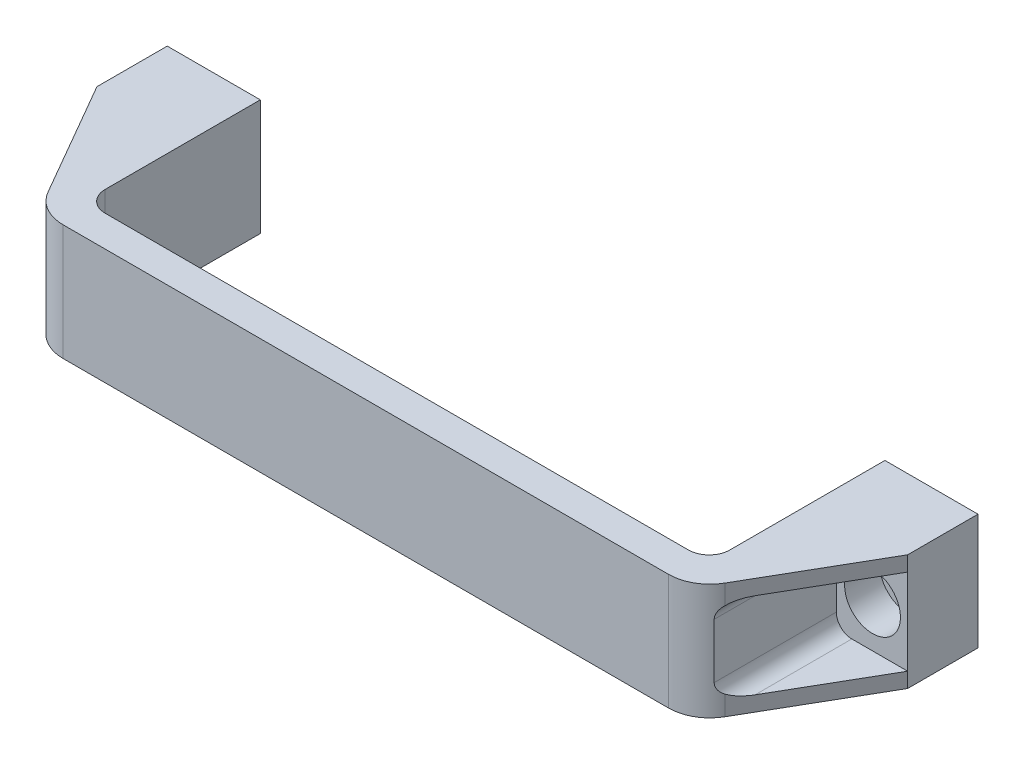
ISO-10303-21;
HEADER;
FILE_DESCRIPTION(('STEP AP214'),'2;1');
FILE_NAME('part.step','',(''),(''),'','','');
FILE_SCHEMA(('AUTOMOTIVE_DESIGN { 1 0 10303 214 1 1 1 1 }'));
ENDSEC;
DATA;
#1=APPLICATION_CONTEXT('core data for automotive mechanical design processes');
#2=APPLICATION_PROTOCOL_DEFINITION('international standard','automotive_design',2000,#1);
#3=PRODUCT_CONTEXT('',#1,'mechanical');
#4=PRODUCT('Part','Part','',(#3));
#5=PRODUCT_RELATED_PRODUCT_CATEGORY('part','',(#4));
#6=PRODUCT_DEFINITION_FORMATION('','',#4);
#7=PRODUCT_DEFINITION_CONTEXT('part definition',#1,'design');
#8=PRODUCT_DEFINITION('design','',#6,#7);
#9=PRODUCT_DEFINITION_SHAPE('','',#8);
#10=(LENGTH_UNIT() NAMED_UNIT(*) SI_UNIT(.MILLI.,.METRE.));
#11=(NAMED_UNIT(*) PLANE_ANGLE_UNIT() SI_UNIT($,.RADIAN.));
#12=(NAMED_UNIT(*) SI_UNIT($,.STERADIAN.) SOLID_ANGLE_UNIT());
#13=UNCERTAINTY_MEASURE_WITH_UNIT(LENGTH_MEASURE(1.E-05),#10,'distance_accuracy_value','');
#14=(GEOMETRIC_REPRESENTATION_CONTEXT(3) GLOBAL_UNCERTAINTY_ASSIGNED_CONTEXT((#13)) GLOBAL_UNIT_ASSIGNED_CONTEXT((#10,
#11,#12)) REPRESENTATION_CONTEXT('',''));
#15=CARTESIAN_POINT('',(0.,0.,0.));
#16=DIRECTION('',(0.,0.,1.));
#17=DIRECTION('',(1.,0.,0.));
#18=AXIS2_PLACEMENT_3D('',#15,#16,#17);
#19=CARTESIAN_POINT('',(0.,5.5,8.5));
#20=DIRECTION('',(0.,0.,-1.));
#21=DIRECTION('',(0.,1.,0.));
#22=AXIS2_PLACEMENT_3D('',#19,#20,#21);
#23=PLANE('',#22);
#24=CARTESIAN_POINT('',(0.,0.,8.5));
#25=DIRECTION('',(0.,0.,-1.));
#26=DIRECTION('',(0.,1.,0.));
#27=AXIS2_PLACEMENT_3D('',#24,#25,#26);
#28=CIRCLE('',#27,4.25);
#29=CARTESIAN_POINT('',(0.,4.25,8.5));
#30=VERTEX_POINT('',#29);
#31=EDGE_CURVE('E194',#30,#30,#28,.T.);
#32=ORIENTED_EDGE('',*,*,#31,.T.);
#33=EDGE_LOOP('',(#32));
#34=FACE_BOUND('',#33,.T.);
#35=CARTESIAN_POINT('',(0.,0.,8.5));
#36=DIRECTION('',(0.,0.,-1.));
#37=DIRECTION('',(0.,1.,0.));
#38=AXIS2_PLACEMENT_3D('',#35,#36,#37);
#39=CIRCLE('',#38,6.75);
#40=CARTESIAN_POINT('',(0.,6.75,8.5));
#41=VERTEX_POINT('',#40);
#42=EDGE_CURVE('E17',#41,#41,#39,.F.);
#43=ORIENTED_EDGE('',*,*,#42,.T.);
#44=EDGE_LOOP('',(#43));
#45=FACE_BOUND('',#44,.T.);
#46=ADVANCED_FACE('F14',(#34,#45),#23,.F.);
#47=CARTESIAN_POINT('',(179.,5.5,8.5));
#48=DIRECTION('',(0.,0.,-1.));
#49=DIRECTION('',(0.,1.,0.));
#50=AXIS2_PLACEMENT_3D('',#47,#48,#49);
#51=PLANE('',#50);
#52=CARTESIAN_POINT('',(179.,0.,8.5));
#53=DIRECTION('',(0.,0.,-1.));
#54=DIRECTION('',(0.,1.,0.));
#55=AXIS2_PLACEMENT_3D('',#52,#53,#54);
#56=CIRCLE('',#55,4.25);
#57=CARTESIAN_POINT('',(179.,4.25,8.5));
#58=VERTEX_POINT('',#57);
#59=EDGE_CURVE('E191',#58,#58,#56,.T.);
#60=ORIENTED_EDGE('',*,*,#59,.T.);
#61=EDGE_LOOP('',(#60));
#62=FACE_BOUND('',#61,.T.);
#63=CARTESIAN_POINT('',(179.,0.,8.5));
#64=DIRECTION('',(0.,0.,-1.));
#65=DIRECTION('',(0.,1.,0.));
#66=AXIS2_PLACEMENT_3D('',#63,#64,#65);
#67=CIRCLE('',#66,6.75);
#68=CARTESIAN_POINT('',(179.,6.75,8.5));
#69=VERTEX_POINT('',#68);
#70=EDGE_CURVE('E196',#69,#69,#67,.F.);
#71=ORIENTED_EDGE('',*,*,#70,.T.);
#72=EDGE_LOOP('',(#71));
#73=FACE_BOUND('',#72,.T.);
#74=ADVANCED_FACE('F207',(#62,#73),#51,.F.);
#75=CARTESIAN_POINT('',(0.,0.,12.75));
#76=DIRECTION('',(0.,0.,-1.));
#77=DIRECTION('',(0.,1.,0.));
#78=AXIS2_PLACEMENT_3D('',#75,#76,#77);
#79=CYLINDRICAL_SURFACE('',#78,6.75);
#80=CARTESIAN_POINT('',(0.,0.,17.));
#81=DIRECTION('',(0.,0.,-1.));
#82=DIRECTION('',(0.,1.,0.));
#83=AXIS2_PLACEMENT_3D('',#80,#81,#82);
#84=CIRCLE('',#83,6.75);
#85=CARTESIAN_POINT('',(0.,6.75,17.));
#86=VERTEX_POINT('',#85);
#87=EDGE_CURVE('E171',#86,#86,#84,.T.);
#88=ORIENTED_EDGE('',*,*,#87,.F.);
#89=EDGE_LOOP('',(#88));
#90=FACE_BOUND('',#89,.T.);
#91=ORIENTED_EDGE('',*,*,#42,.F.);
#92=EDGE_LOOP('',(#91));
#93=FACE_BOUND('',#92,.T.);
#94=ADVANCED_FACE('F204',(#90,#93),#79,.F.);
#95=CARTESIAN_POINT('',(179.,0.,12.75));
#96=DIRECTION('',(0.,0.,-1.));
#97=DIRECTION('',(0.,1.,0.));
#98=AXIS2_PLACEMENT_3D('',#95,#96,#97);
#99=CYLINDRICAL_SURFACE('',#98,6.75);
#100=CARTESIAN_POINT('',(179.,0.,17.));
#101=DIRECTION('',(0.,0.,-1.));
#102=DIRECTION('',(0.,1.,0.));
#103=AXIS2_PLACEMENT_3D('',#100,#101,#102);
#104=CIRCLE('',#103,6.75);
#105=CARTESIAN_POINT('',(179.,6.75,17.));
#106=VERTEX_POINT('',#105);
#107=EDGE_CURVE('E185',#106,#106,#104,.T.);
#108=ORIENTED_EDGE('',*,*,#107,.F.);
#109=EDGE_LOOP('',(#108));
#110=FACE_BOUND('',#109,.T.);
#111=ORIENTED_EDGE('',*,*,#70,.F.);
#112=EDGE_LOOP('',(#111));
#113=FACE_BOUND('',#112,.T.);
#114=ADVANCED_FACE('F206',(#110,#113),#99,.F.);
#115=CARTESIAN_POINT('',(-10.5,10.375,17.));
#116=DIRECTION('',(0.,1.,0.));
#117=DIRECTION('',(-1.,0.,0.));
#118=AXIS2_PLACEMENT_3D('',#115,#116,#117);
#119=PLANE('',#118);
#120=DIRECTION('',(1.,0.,0.));
#121=VECTOR('',#120,1.);
#122=CARTESIAN_POINT('',(89.5,10.375,17.));
#123=LINE('',#122,#121);
#124=CARTESIAN_POINT('',(5.,10.375,17.));
#125=VERTEX_POINT('',#124);
#126=CARTESIAN_POINT('',(-8.5,10.375,17.));
#127=VERTEX_POINT('',#126);
#128=EDGE_CURVE('E170',#125,#127,#123,.F.);
#129=ORIENTED_EDGE('',*,*,#128,.F.);
#130=DIRECTION('',(0.,0.,-1.));
#131=VECTOR('',#130,1.);
#132=CARTESIAN_POINT('',(5.,10.375,17.));
#133=LINE('',#132,#131);
#134=CARTESIAN_POINT('',(5.,10.375,40.3826859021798));
#135=VERTEX_POINT('',#134);
#136=EDGE_CURVE('E385',#125,#135,#133,.F.);
#137=ORIENTED_EDGE('',*,*,#136,.T.);
#138=DIRECTION('',(-0.5,0.,-0.866025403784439));
#139=VECTOR('',#138,1.);
#140=CARTESIAN_POINT('',(7.6658075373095,10.375,45.));
#141=LINE('',#140,#139);
#142=EDGE_CURVE('E177',#127,#135,#141,.F.);
#143=ORIENTED_EDGE('',*,*,#142,.F.);
#144=EDGE_LOOP('',(#129,#137,#143));
#145=FACE_BOUND('',#144,.T.);
#146=ADVANCED_FACE('F215',(#145),#119,.F.);
#147=CARTESIAN_POINT('',(0.,0.,4.25));
#148=DIRECTION('',(0.,0.,-1.));
#149=DIRECTION('',(0.,1.,0.));
#150=AXIS2_PLACEMENT_3D('',#147,#148,#149);
#151=CYLINDRICAL_SURFACE('',#150,4.25);
#152=CARTESIAN_POINT('',(0.,0.,0.));
#153=DIRECTION('',(0.,0.,-1.));
#154=DIRECTION('',(0.,1.,0.));
#155=AXIS2_PLACEMENT_3D('',#152,#153,#154);
#156=CIRCLE('',#155,4.25);
#157=CARTESIAN_POINT('',(0.,4.25,0.));
#158=VERTEX_POINT('',#157);
#159=EDGE_CURVE('E437',#158,#158,#156,.F.);
#160=ORIENTED_EDGE('',*,*,#159,.F.);
#161=EDGE_LOOP('',(#160));
#162=FACE_BOUND('',#161,.T.);
#163=ORIENTED_EDGE('',*,*,#31,.F.);
#164=EDGE_LOOP('',(#163));
#165=FACE_BOUND('',#164,.T.);
#166=ADVANCED_FACE('F374',(#162,#165),#151,.F.);
#167=CARTESIAN_POINT('',(179.,0.,4.25));
#168=DIRECTION('',(0.,0.,-1.));
#169=DIRECTION('',(0.,1.,0.));
#170=AXIS2_PLACEMENT_3D('',#167,#168,#169);
#171=CYLINDRICAL_SURFACE('',#170,4.25);
#172=CARTESIAN_POINT('',(179.,0.,0.));
#173=DIRECTION('',(0.,0.,-1.));
#174=DIRECTION('',(0.,1.,0.));
#175=AXIS2_PLACEMENT_3D('',#172,#173,#174);
#176=CIRCLE('',#175,4.25);
#177=CARTESIAN_POINT('',(179.,4.25,0.));
#178=VERTEX_POINT('',#177);
#179=EDGE_CURVE('E463',#178,#178,#176,.F.);
#180=ORIENTED_EDGE('',*,*,#179,.F.);
#181=EDGE_LOOP('',(#180));
#182=FACE_BOUND('',#181,.T.);
#183=ORIENTED_EDGE('',*,*,#59,.F.);
#184=EDGE_LOOP('',(#183));
#185=FACE_BOUND('',#184,.T.);
#186=ADVANCED_FACE('F371',(#182,#185),#171,.F.);
#187=CARTESIAN_POINT('',(5.,-10.375,17.));
#188=DIRECTION('',(0.,-1.,0.));
#189=DIRECTION('',(1.,0.,0.));
#190=AXIS2_PLACEMENT_3D('',#187,#188,#189);
#191=PLANE('',#190);
#192=DIRECTION('',(0.,0.,-1.));
#193=VECTOR('',#192,1.);
#194=CARTESIAN_POINT('',(5.,-10.375,17.));
#195=LINE('',#194,#193);
#196=CARTESIAN_POINT('',(5.,-10.375,40.3826859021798));
#197=VERTEX_POINT('',#196);
#198=CARTESIAN_POINT('',(5.,-10.375,17.));
#199=VERTEX_POINT('',#198);
#200=EDGE_CURVE('E147',#197,#199,#195,.T.);
#201=ORIENTED_EDGE('',*,*,#200,.T.);
#202=DIRECTION('',(1.,0.,0.));
#203=VECTOR('',#202,1.);
#204=CARTESIAN_POINT('',(89.5,-10.375,17.));
#205=LINE('',#204,#203);
#206=CARTESIAN_POINT('',(-8.5,-10.375,17.));
#207=VERTEX_POINT('',#206);
#208=EDGE_CURVE('E150',#207,#199,#205,.T.);
#209=ORIENTED_EDGE('',*,*,#208,.F.);
#210=DIRECTION('',(-0.5,0.,-0.866025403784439));
#211=VECTOR('',#210,1.);
#212=CARTESIAN_POINT('',(7.6658075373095,-10.375,45.));
#213=LINE('',#212,#211);
#214=EDGE_CURVE('E152',#197,#207,#213,.T.);
#215=ORIENTED_EDGE('',*,*,#214,.F.);
#216=EDGE_LOOP('',(#201,#209,#215));
#217=FACE_BOUND('',#216,.T.);
#218=ADVANCED_FACE('F149',(#217),#191,.F.);
#219=CARTESIAN_POINT('',(89.5,0.,17.));
#220=DIRECTION('',(0.,0.,1.));
#221=DIRECTION('',(0.,-1.,0.));
#222=AXIS2_PLACEMENT_3D('',#219,#220,#221);
#223=PLANE('',#222);
#224=CARTESIAN_POINT('',(5.,6.625,17.));
#225=DIRECTION('',(0.,0.,-1.));
#226=DIRECTION('',(0.,1.,0.));
#227=AXIS2_PLACEMENT_3D('',#224,#225,#226);
#228=CIRCLE('',#227,3.75);
#229=CARTESIAN_POINT('',(8.75,6.625,17.));
#230=VERTEX_POINT('',#229);
#231=EDGE_CURVE('E180',#230,#125,#228,.F.);
#232=ORIENTED_EDGE('',*,*,#231,.T.);
#233=ORIENTED_EDGE('',*,*,#128,.T.);
#234=DIRECTION('',(0.,-1.,0.));
#235=VECTOR('',#234,1.);
#236=CARTESIAN_POINT('',(-8.5,-14.,17.));
#237=LINE('',#236,#235);
#238=EDGE_CURVE('E168',#207,#127,#237,.F.);
#239=ORIENTED_EDGE('',*,*,#238,.F.);
#240=ORIENTED_EDGE('',*,*,#208,.T.);
#241=CARTESIAN_POINT('',(5.,-6.625,17.));
#242=DIRECTION('',(0.,0.,-1.));
#243=DIRECTION('',(0.,1.,0.));
#244=AXIS2_PLACEMENT_3D('',#241,#242,#243);
#245=CIRCLE('',#244,3.75);
#246=CARTESIAN_POINT('',(8.75,-6.625,17.));
#247=VERTEX_POINT('',#246);
#248=EDGE_CURVE('E156',#199,#247,#245,.F.);
#249=ORIENTED_EDGE('',*,*,#248,.T.);
#250=DIRECTION('',(0.,1.,0.));
#251=VECTOR('',#250,1.);
#252=CARTESIAN_POINT('',(8.75,6.625,17.));
#253=LINE('',#252,#251);
#254=EDGE_CURVE('E389',#247,#230,#253,.T.);
#255=ORIENTED_EDGE('',*,*,#254,.T.);
#256=EDGE_LOOP('',(#232,#233,#239,#240,#249,#255));
#257=FACE_BOUND('',#256,.T.);
#258=ORIENTED_EDGE('',*,*,#87,.T.);
#259=EDGE_LOOP('',(#258));
#260=FACE_BOUND('',#259,.T.);
#261=ADVANCED_FACE('F163',(#257,#260),#223,.T.);
#262=CARTESIAN_POINT('',(174.,10.375,17.));
#263=DIRECTION('',(0.,1.,0.));
#264=DIRECTION('',(-1.,0.,0.));
#265=AXIS2_PLACEMENT_3D('',#262,#263,#264);
#266=PLANE('',#265);
#267=DIRECTION('',(0.,0.,-1.));
#268=VECTOR('',#267,1.);
#269=CARTESIAN_POINT('',(174.,10.375,17.));
#270=LINE('',#269,#268);
#271=CARTESIAN_POINT('',(174.,10.375,40.3826859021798));
#272=VERTEX_POINT('',#271);
#273=CARTESIAN_POINT('',(174.,10.375,17.));
#274=VERTEX_POINT('',#273);
#275=EDGE_CURVE('E408',#272,#274,#270,.T.);
#276=ORIENTED_EDGE('',*,*,#275,.T.);
#277=DIRECTION('',(1.,0.,0.));
#278=VECTOR('',#277,1.);
#279=CARTESIAN_POINT('',(89.5,10.375,17.));
#280=LINE('',#279,#278);
#281=CARTESIAN_POINT('',(187.5,10.375,17.));
#282=VERTEX_POINT('',#281);
#283=EDGE_CURVE('E188',#282,#274,#280,.F.);
#284=ORIENTED_EDGE('',*,*,#283,.F.);
#285=DIRECTION('',(-0.5,0.,0.866025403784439));
#286=VECTOR('',#285,1.);
#287=CARTESIAN_POINT('',(187.5,10.375,17.));
#288=LINE('',#287,#286);
#289=EDGE_CURVE('E413',#272,#282,#288,.F.);
#290=ORIENTED_EDGE('',*,*,#289,.F.);
#291=EDGE_LOOP('',(#276,#284,#290));
#292=FACE_BOUND('',#291,.T.);
#293=ADVANCED_FACE('F362',(#292),#266,.F.);
#294=CARTESIAN_POINT('',(189.5,-10.375,17.));
#295=DIRECTION('',(0.,-1.,0.));
#296=DIRECTION('',(1.,0.,0.));
#297=AXIS2_PLACEMENT_3D('',#294,#295,#296);
#298=PLANE('',#297);
#299=DIRECTION('',(1.,0.,0.));
#300=VECTOR('',#299,1.);
#301=CARTESIAN_POINT('',(89.5,-10.375,17.));
#302=LINE('',#301,#300);
#303=CARTESIAN_POINT('',(174.,-10.375,17.));
#304=VERTEX_POINT('',#303);
#305=CARTESIAN_POINT('',(187.5,-10.375,17.));
#306=VERTEX_POINT('',#305);
#307=EDGE_CURVE('E157',#304,#306,#302,.T.);
#308=ORIENTED_EDGE('',*,*,#307,.F.);
#309=DIRECTION('',(0.,0.,-1.));
#310=VECTOR('',#309,1.);
#311=CARTESIAN_POINT('',(174.,-10.375,17.));
#312=LINE('',#311,#310);
#313=CARTESIAN_POINT('',(174.,-10.375,40.3826859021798));
#314=VERTEX_POINT('',#313);
#315=EDGE_CURVE('E492',#304,#314,#312,.F.);
#316=ORIENTED_EDGE('',*,*,#315,.T.);
#317=DIRECTION('',(-0.5,0.,0.866025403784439));
#318=VECTOR('',#317,1.);
#319=CARTESIAN_POINT('',(187.5,-10.375,17.));
#320=LINE('',#319,#318);
#321=EDGE_CURVE('E478',#306,#314,#320,.T.);
#322=ORIENTED_EDGE('',*,*,#321,.F.);
#323=EDGE_LOOP('',(#308,#316,#322));
#324=FACE_BOUND('',#323,.T.);
#325=ADVANCED_FACE('F358',(#324),#298,.F.);
#326=CARTESIAN_POINT('',(89.5,0.,17.));
#327=DIRECTION('',(0.,0.,1.));
#328=DIRECTION('',(0.,-1.,0.));
#329=AXIS2_PLACEMENT_3D('',#326,#327,#328);
#330=PLANE('',#329);
#331=CARTESIAN_POINT('',(174.,-6.625,17.));
#332=DIRECTION('',(0.,0.,-1.));
#333=DIRECTION('',(0.,1.,0.));
#334=AXIS2_PLACEMENT_3D('',#331,#332,#333);
#335=CIRCLE('',#334,3.75);
#336=CARTESIAN_POINT('',(170.25,-6.625,17.));
#337=VERTEX_POINT('',#336);
#338=EDGE_CURVE('E491',#337,#304,#335,.F.);
#339=ORIENTED_EDGE('',*,*,#338,.T.);
#340=ORIENTED_EDGE('',*,*,#307,.T.);
#341=DIRECTION('',(0.,1.,0.));
#342=VECTOR('',#341,1.);
#343=CARTESIAN_POINT('',(187.5,-14.,17.));
#344=LINE('',#343,#342);
#345=EDGE_CURVE('E430',#282,#306,#344,.F.);
#346=ORIENTED_EDGE('',*,*,#345,.F.);
#347=ORIENTED_EDGE('',*,*,#283,.T.);
#348=CARTESIAN_POINT('',(174.,6.625,17.));
#349=DIRECTION('',(0.,0.,-1.));
#350=DIRECTION('',(0.,1.,0.));
#351=AXIS2_PLACEMENT_3D('',#348,#349,#350);
#352=CIRCLE('',#351,3.75);
#353=CARTESIAN_POINT('',(170.25,6.625,17.));
#354=VERTEX_POINT('',#353);
#355=EDGE_CURVE('E485',#274,#354,#352,.F.);
#356=ORIENTED_EDGE('',*,*,#355,.T.);
#357=DIRECTION('',(0.,-1.,0.));
#358=VECTOR('',#357,1.);
#359=CARTESIAN_POINT('',(170.25,-6.625,17.));
#360=LINE('',#359,#358);
#361=EDGE_CURVE('E422',#354,#337,#360,.T.);
#362=ORIENTED_EDGE('',*,*,#361,.T.);
#363=EDGE_LOOP('',(#339,#340,#346,#347,#356,#362));
#364=FACE_BOUND('',#363,.T.);
#365=ORIENTED_EDGE('',*,*,#107,.T.);
#366=EDGE_LOOP('',(#365));
#367=FACE_BOUND('',#366,.T.);
#368=ADVANCED_FACE('F355',(#364,#367),#330,.T.);
#369=CARTESIAN_POINT('',(5.,-6.625,17.));
#370=DIRECTION('',(0.,0.,-1.));
#371=DIRECTION('',(0.,1.,0.));
#372=AXIS2_PLACEMENT_3D('',#369,#370,#371);
#373=CYLINDRICAL_SURFACE('',#372,3.75);
#374=CARTESIAN_POINT('',(8.75,-6.625,46.5271196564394));
#375=CARTESIAN_POINT('',(8.75001813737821,-6.70081293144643,46.5271289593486));
#376=CARTESIAN_POINT('',(8.7477014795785,-6.7766163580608,46.5244514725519));
#377=CARTESIAN_POINT('',(8.73853544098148,-6.92753868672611,46.5137959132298));
#378=CARTESIAN_POINT('',(8.7316882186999,-7.00265789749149,46.5058203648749));
#379=CARTESIAN_POINT('',(8.71365576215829,-7.15114138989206,46.4847095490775));
#380=CARTESIAN_POINT('',(8.70249866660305,-7.22451384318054,46.4716077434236));
#381=CARTESIAN_POINT('',(8.67610871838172,-7.36941809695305,46.4403911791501));
#382=CARTESIAN_POINT('',(8.66087559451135,-7.44094977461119,46.4222760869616));
#383=CARTESIAN_POINT('',(8.60957242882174,-7.65179648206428,46.3607125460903));
#384=CARTESIAN_POINT('',(8.56785315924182,-7.78771945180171,46.309994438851));
#385=CARTESIAN_POINT('',(8.47261351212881,-8.04720401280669,46.1910527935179));
#386=CARTESIAN_POINT('',(8.41907644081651,-8.17074775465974,46.1228044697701));
#387=CARTESIAN_POINT('',(8.28779719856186,-8.43620644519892,45.9498789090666));
#388=CARTESIAN_POINT('',(8.20746442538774,-8.57367289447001,45.8403491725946));
#389=CARTESIAN_POINT('',(8.04053348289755,-8.82512481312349,45.6010089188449));
#390=CARTESIAN_POINT('',(7.95392701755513,-8.93907839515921,45.4711712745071));
#391=CARTESIAN_POINT('',(7.83341689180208,-9.08202682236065,45.2800597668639));
#392=CARTESIAN_POINT('',(7.7996679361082,-9.12036555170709,45.2254054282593));
#393=CARTESIAN_POINT('',(7.73248338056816,-9.19375351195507,45.1141576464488));
#394=CARTESIAN_POINT('',(7.69904705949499,-9.22881592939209,45.0575733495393));
#395=CARTESIAN_POINT('',(7.66580753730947,-9.26241733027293,45.));
#396=B_SPLINE_CURVE_WITH_KNOTS('',3,(#374,#375,#376,#377,#378,#379,#380,#381,#382,#383,#384,
#385,#386,#387,#388,#389,#390,#391,#392,#393,#394,#395),.UNSPECIFIED.,.F.,.F.,(4,2,2,2,2,2,2,2,
2,2,4),(0.,0.227340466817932,0.454572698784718,0.680345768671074,0.906133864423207,
1.35663665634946,1.80777994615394,2.38441044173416,2.96181787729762,3.18616758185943,
3.40957146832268),.UNSPECIFIED.);
#397=CARTESIAN_POINT('',(8.75,-6.625,46.5271196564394));
#398=VERTEX_POINT('',#397);
#399=CARTESIAN_POINT('',(7.66580753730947,-9.26241733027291,45.));
#400=VERTEX_POINT('',#399);
#401=EDGE_CURVE('E341',#398,#400,#396,.T.);
#402=ORIENTED_EDGE('',*,*,#401,.F.);
#403=DIRECTION('',(0.,0.,1.));
#404=VECTOR('',#403,1.);
#405=CARTESIAN_POINT('',(8.75,-6.625,17.));
#406=LINE('',#405,#404);
#407=EDGE_CURVE('E175',#398,#247,#406,.F.);
#408=ORIENTED_EDGE('',*,*,#407,.T.);
#409=ORIENTED_EDGE('',*,*,#248,.F.);
#410=ORIENTED_EDGE('',*,*,#200,.F.);
#411=CARTESIAN_POINT('',(5.,-6.625,40.3826859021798));
#412=DIRECTION('',(-0.866025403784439,0.,0.5));
#413=DIRECTION('',(-0.5,0.,-0.866025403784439));
#414=AXIS2_PLACEMENT_3D('',#411,#412,#413);
#415=ELLIPSE('',#414,7.5,3.75);
#416=EDGE_CURVE('E446',#400,#197,#415,.F.);
#417=ORIENTED_EDGE('',*,*,#416,.F.);
#418=EDGE_LOOP('',(#402,#408,#409,#410,#417));
#419=FACE_BOUND('',#418,.T.);
#420=ADVANCED_FACE('F173',(#419),#373,.F.);
#421=CARTESIAN_POINT('',(7.6658075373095,-14.,45.));
#422=DIRECTION('',(-0.866025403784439,0.,0.5));
#423=DIRECTION('',(-0.5,0.,-0.866025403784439));
#424=AXIS2_PLACEMENT_3D('',#421,#422,#423);
#425=PLANE('',#424);
#426=DIRECTION('',(-0.5,0.,-0.866025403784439));
#427=VECTOR('',#426,1.);
#428=CARTESIAN_POINT('',(7.6658075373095,14.,45.));
#429=LINE('',#428,#427);
#430=CARTESIAN_POINT('',(7.66580753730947,14.,45.));
#431=VERTEX_POINT('',#430);
#432=CARTESIAN_POINT('',(-8.5,14.,17.));
#433=VERTEX_POINT('',#432);
#434=EDGE_CURVE('E404',#431,#433,#429,.T.);
#435=ORIENTED_EDGE('',*,*,#434,.T.);
#436=DIRECTION('',(0.,-1.,0.));
#437=VECTOR('',#436,1.);
#438=CARTESIAN_POINT('',(-8.5,-14.,17.));
#439=LINE('',#438,#437);
#440=EDGE_CURVE('E405',#127,#433,#439,.F.);
#441=ORIENTED_EDGE('',*,*,#440,.F.);
#442=ORIENTED_EDGE('',*,*,#142,.T.);
#443=CARTESIAN_POINT('',(5.,6.625,40.3826859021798));
#444=DIRECTION('',(-0.866025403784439,0.,0.5));
#445=DIRECTION('',(-0.5,0.,-0.866025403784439));
#446=AXIS2_PLACEMENT_3D('',#443,#444,#445);
#447=ELLIPSE('',#446,7.5,3.75);
#448=CARTESIAN_POINT('',(7.66580753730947,9.26241733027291,45.));
#449=VERTEX_POINT('',#448);
#450=EDGE_CURVE('E393',#135,#449,#447,.F.);
#451=ORIENTED_EDGE('',*,*,#450,.T.);
#452=DIRECTION('',(0.,-1.,0.));
#453=VECTOR('',#452,1.);
#454=CARTESIAN_POINT('',(7.66580753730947,-14.,45.));
#455=LINE('',#454,#453);
#456=EDGE_CURVE('E329',#431,#449,#455,.T.);
#457=ORIENTED_EDGE('',*,*,#456,.F.);
#458=EDGE_LOOP('',(#435,#441,#442,#451,#457));
#459=FACE_BOUND('',#458,.T.);
#460=ADVANCED_FACE('F316',(#459),#425,.T.);
#461=CARTESIAN_POINT('',(5.,6.625,17.));
#462=DIRECTION('',(0.,0.,-1.));
#463=DIRECTION('',(0.,1.,0.));
#464=AXIS2_PLACEMENT_3D('',#461,#462,#463);
#465=CYLINDRICAL_SURFACE('',#464,3.75);
#466=ORIENTED_EDGE('',*,*,#136,.F.);
#467=ORIENTED_EDGE('',*,*,#231,.F.);
#468=DIRECTION('',(0.,0.,1.));
#469=VECTOR('',#468,1.);
#470=CARTESIAN_POINT('',(8.75,6.625,17.));
#471=LINE('',#470,#469);
#472=CARTESIAN_POINT('',(8.75,6.625,46.5271196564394));
#473=VERTEX_POINT('',#472);
#474=EDGE_CURVE('E436',#230,#473,#471,.T.);
#475=ORIENTED_EDGE('',*,*,#474,.T.);
#476=CARTESIAN_POINT('',(7.66580753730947,9.26241733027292,45.));
#477=CARTESIAN_POINT('',(7.71040386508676,9.2173299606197,45.0772671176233));
#478=CARTESIAN_POINT('',(7.75540206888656,9.16956960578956,45.1527947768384));
#479=CARTESIAN_POINT('',(7.84561451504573,9.06827695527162,45.2999448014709));
#480=CARTESIAN_POINT('',(7.89082898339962,9.01473588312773,45.3715609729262));
#481=CARTESIAN_POINT('',(7.98108212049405,8.9011681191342,45.5107404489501));
#482=CARTESIAN_POINT('',(8.0261169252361,8.84109578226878,45.5782693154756));
#483=CARTESIAN_POINT('',(8.11479569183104,8.7146204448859,45.7080022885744));
#484=CARTESIAN_POINT('',(8.15844048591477,8.6482213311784,45.7702096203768));
#485=CARTESIAN_POINT('',(8.27045060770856,8.46468285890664,45.9263214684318));
#486=CARTESIAN_POINT('',(8.33693420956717,8.34207600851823,46.0153000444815));
#487=CARTESIAN_POINT('',(8.45904164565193,8.08041713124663,46.1741459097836));
#488=CARTESIAN_POINT('',(8.51469201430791,7.94140666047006,46.2440600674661));
#489=CARTESIAN_POINT('',(8.58683473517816,7.72189167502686,46.3329175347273));
#490=CARTESIAN_POINT('',(8.60908165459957,7.64645257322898,46.3599688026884));
#491=CARTESIAN_POINT('',(8.64911917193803,7.49260030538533,46.4082399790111));
#492=CARTESIAN_POINT('',(8.66691208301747,7.41418870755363,46.4294629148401));
#493=CARTESIAN_POINT('',(8.69756496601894,7.25513429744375,46.4658027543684));
#494=CARTESIAN_POINT('',(8.71043125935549,7.17449448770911,46.480927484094));
#495=CARTESIAN_POINT('',(8.7309116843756,7.01167601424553,46.5049173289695));
#496=CARTESIAN_POINT('',(8.73853001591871,6.9294986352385,46.5137874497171));
#497=CARTESIAN_POINT('',(8.7456148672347,6.81004459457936,46.5220270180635));
#498=CARTESIAN_POINT('',(8.74725970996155,6.77304712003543,46.5239379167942));
#499=CARTESIAN_POINT('',(8.74945153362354,6.69903515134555,46.526483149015));
#500=CARTESIAN_POINT('',(8.75000026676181,6.66202077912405,46.527119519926));
#501=CARTESIAN_POINT('',(8.75,6.625,46.5271196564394));
#502=B_SPLINE_CURVE_WITH_KNOTS('',3,(#476,#477,#478,#479,#480,#481,#482,#483,#484,#485,#486,
#487,#488,#489,#490,#491,#492,#493,#494,#495,#496,#497,#498,#499,#500,#501),.UNSPECIFIED.,.F.,
.F.,(4,2,2,2,2,2,2,2,2,2,2,2,4),(0.,0.299886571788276,0.600235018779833,0.902836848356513,
1.20525396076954,1.69951464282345,2.19254903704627,2.44175081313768,2.69082289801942,
2.93957431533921,3.18812642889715,3.29934443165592,3.41038450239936),.UNSPECIFIED.);
#503=EDGE_CURVE('E320',#449,#473,#502,.T.);
#504=ORIENTED_EDGE('',*,*,#503,.F.);
#505=ORIENTED_EDGE('',*,*,#450,.F.);
#506=EDGE_LOOP('',(#466,#467,#475,#504,#505));
#507=FACE_BOUND('',#506,.T.);
#508=ADVANCED_FACE('F311',(#507),#465,.F.);
#509=CARTESIAN_POINT('',(8.75,6.625,17.));
#510=DIRECTION('',(1.,0.,0.));
#511=DIRECTION('',(0.,1.,0.));
#512=AXIS2_PLACEMENT_3D('',#509,#510,#511);
#513=PLANE('',#512);
#514=ORIENTED_EDGE('',*,*,#474,.F.);
#515=ORIENTED_EDGE('',*,*,#254,.F.);
#516=ORIENTED_EDGE('',*,*,#407,.F.);
#517=DIRECTION('',(0.,-1.,0.));
#518=VECTOR('',#517,1.);
#519=CARTESIAN_POINT('',(8.75,-14.,46.5271196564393));
#520=LINE('',#519,#518);
#521=EDGE_CURVE('E328',#473,#398,#520,.T.);
#522=ORIENTED_EDGE('',*,*,#521,.F.);
#523=EDGE_LOOP('',(#514,#515,#516,#522));
#524=FACE_BOUND('',#523,.T.);
#525=ADVANCED_FACE('F307',(#524),#513,.F.);
#526=CARTESIAN_POINT('',(-8.5,-14.,0.));
#527=DIRECTION('',(0.,0.,-1.));
#528=DIRECTION('',(0.,1.,0.));
#529=AXIS2_PLACEMENT_3D('',#526,#527,#528);
#530=PLANE('',#529);
#531=DIRECTION('',(1.,0.,0.));
#532=VECTOR('',#531,1.);
#533=CARTESIAN_POINT('',(89.5,-14.,0.));
#534=LINE('',#533,#532);
#535=CARTESIAN_POINT('',(-8.5,-14.,0.));
#536=VERTEX_POINT('',#535);
#537=CARTESIAN_POINT('',(14.,-14.,0.));
#538=VERTEX_POINT('',#537);
#539=EDGE_CURVE('E447',#536,#538,#534,.T.);
#540=ORIENTED_EDGE('',*,*,#539,.F.);
#541=DIRECTION('',(0.,-1.,0.));
#542=VECTOR('',#541,1.);
#543=CARTESIAN_POINT('',(-8.5,-14.,0.));
#544=LINE('',#543,#542);
#545=CARTESIAN_POINT('',(-8.5,14.,0.));
#546=VERTEX_POINT('',#545);
#547=EDGE_CURVE('E443',#546,#536,#544,.T.);
#548=ORIENTED_EDGE('',*,*,#547,.F.);
#549=DIRECTION('',(1.,0.,0.));
#550=VECTOR('',#549,1.);
#551=CARTESIAN_POINT('',(89.5,14.,0.));
#552=LINE('',#551,#550);
#553=CARTESIAN_POINT('',(14.,14.,0.));
#554=VERTEX_POINT('',#553);
#555=EDGE_CURVE('E398',#546,#554,#552,.T.);
#556=ORIENTED_EDGE('',*,*,#555,.T.);
#557=DIRECTION('',(0.,1.,0.));
#558=VECTOR('',#557,1.);
#559=CARTESIAN_POINT('',(14.,-14.,0.));
#560=LINE('',#559,#558);
#561=EDGE_CURVE('E440',#538,#554,#560,.T.);
#562=ORIENTED_EDGE('',*,*,#561,.F.);
#563=EDGE_LOOP('',(#540,#548,#556,#562));
#564=FACE_BOUND('',#563,.T.);
#565=ORIENTED_EDGE('',*,*,#159,.T.);
#566=EDGE_LOOP('',(#565));
#567=FACE_BOUND('',#566,.T.);
#568=ADVANCED_FACE('F303',(#564,#567),#530,.T.);
#569=CARTESIAN_POINT('',(14.,-14.,0.));
#570=DIRECTION('',(1.,0.,0.));
#571=DIRECTION('',(0.,1.,0.));
#572=AXIS2_PLACEMENT_3D('',#569,#570,#571);
#573=PLANE('',#572);
#574=DIRECTION('',(0.,0.,1.));
#575=VECTOR('',#574,1.);
#576=CARTESIAN_POINT('',(14.,-14.,0.));
#577=LINE('',#576,#575);
#578=CARTESIAN_POINT('',(14.,-14.,37.5));
#579=VERTEX_POINT('',#578);
#580=EDGE_CURVE('E450',#538,#579,#577,.T.);
#581=ORIENTED_EDGE('',*,*,#580,.F.);
#582=ORIENTED_EDGE('',*,*,#561,.T.);
#583=DIRECTION('',(0.,0.,1.));
#584=VECTOR('',#583,1.);
#585=CARTESIAN_POINT('',(14.,14.,0.));
#586=LINE('',#585,#584);
#587=CARTESIAN_POINT('',(14.,14.,37.5));
#588=VERTEX_POINT('',#587);
#589=EDGE_CURVE('E349',#554,#588,#586,.T.);
#590=ORIENTED_EDGE('',*,*,#589,.T.);
#591=DIRECTION('',(0.,-1.,0.));
#592=VECTOR('',#591,1.);
#593=CARTESIAN_POINT('',(14.,-14.,37.5));
#594=LINE('',#593,#592);
#595=EDGE_CURVE('E453',#588,#579,#594,.T.);
#596=ORIENTED_EDGE('',*,*,#595,.T.);
#597=EDGE_LOOP('',(#581,#582,#590,#596));
#598=FACE_BOUND('',#597,.T.);
#599=ADVANCED_FACE('F299',(#598),#573,.T.);
#600=CARTESIAN_POINT('',(19.,-14.,37.5));
#601=DIRECTION('',(0.,-1.,0.));
#602=DIRECTION('',(1.,0.,0.));
#603=AXIS2_PLACEMENT_3D('',#600,#601,#602);
#604=CYLINDRICAL_SURFACE('',#603,5.);
#605=DIRECTION('',(0.,1.,0.));
#606=VECTOR('',#605,1.);
#607=CARTESIAN_POINT('',(19.,-14.,42.5));
#608=LINE('',#607,#606);
#609=CARTESIAN_POINT('',(19.,-14.,42.5));
#610=VERTEX_POINT('',#609);
#611=CARTESIAN_POINT('',(19.,14.,42.5));
#612=VERTEX_POINT('',#611);
#613=EDGE_CURVE('E455',#610,#612,#608,.T.);
#614=ORIENTED_EDGE('',*,*,#613,.F.);
#615=CARTESIAN_POINT('',(19.,-14.,37.5));
#616=DIRECTION('',(0.,-1.,0.));
#617=DIRECTION('',(1.,0.,0.));
#618=AXIS2_PLACEMENT_3D('',#615,#616,#617);
#619=CIRCLE('',#618,5.);
#620=EDGE_CURVE('E330',#579,#610,#619,.F.);
#621=ORIENTED_EDGE('',*,*,#620,.F.);
#622=ORIENTED_EDGE('',*,*,#595,.F.);
#623=CARTESIAN_POINT('',(19.,14.,37.5));
#624=DIRECTION('',(0.,-1.,0.));
#625=DIRECTION('',(1.,0.,0.));
#626=AXIS2_PLACEMENT_3D('',#623,#624,#625);
#627=CIRCLE('',#626,5.);
#628=EDGE_CURVE('E499',#588,#612,#627,.F.);
#629=ORIENTED_EDGE('',*,*,#628,.T.);
#630=EDGE_LOOP('',(#614,#621,#622,#629));
#631=FACE_BOUND('',#630,.T.);
#632=ADVANCED_FACE('F295',(#631),#604,.F.);
#633=CARTESIAN_POINT('',(19.,-14.,42.5));
#634=DIRECTION('',(0.,0.,-1.));
#635=DIRECTION('',(0.,1.,0.));
#636=AXIS2_PLACEMENT_3D('',#633,#634,#635);
#637=PLANE('',#636);
#638=DIRECTION('',(1.,0.,0.));
#639=VECTOR('',#638,1.);
#640=CARTESIAN_POINT('',(89.5,-14.,42.5));
#641=LINE('',#640,#639);
#642=CARTESIAN_POINT('',(160.,-14.,42.5));
#643=VERTEX_POINT('',#642);
#644=EDGE_CURVE('E524',#610,#643,#641,.T.);
#645=ORIENTED_EDGE('',*,*,#644,.F.);
#646=ORIENTED_EDGE('',*,*,#613,.T.);
#647=DIRECTION('',(1.,0.,0.));
#648=VECTOR('',#647,1.);
#649=CARTESIAN_POINT('',(89.5,14.,42.5));
#650=LINE('',#649,#648);
#651=CARTESIAN_POINT('',(160.,14.,42.5));
#652=VERTEX_POINT('',#651);
#653=EDGE_CURVE('E500',#612,#652,#650,.T.);
#654=ORIENTED_EDGE('',*,*,#653,.T.);
#655=DIRECTION('',(0.,-1.,0.));
#656=VECTOR('',#655,1.);
#657=CARTESIAN_POINT('',(160.,-14.,42.5));
#658=LINE('',#657,#656);
#659=EDGE_CURVE('E458',#652,#643,#658,.T.);
#660=ORIENTED_EDGE('',*,*,#659,.T.);
#661=EDGE_LOOP('',(#645,#646,#654,#660));
#662=FACE_BOUND('',#661,.T.);
#663=ADVANCED_FACE('F291',(#662),#637,.T.);
#664=CARTESIAN_POINT('',(160.,-14.,37.5));
#665=DIRECTION('',(0.,-1.,0.));
#666=DIRECTION('',(1.,0.,0.));
#667=AXIS2_PLACEMENT_3D('',#664,#665,#666);
#668=CYLINDRICAL_SURFACE('',#667,5.);
#669=DIRECTION('',(0.,-1.,0.));
#670=VECTOR('',#669,1.);
#671=CARTESIAN_POINT('',(165.,-14.,37.5));
#672=LINE('',#671,#670);
#673=CARTESIAN_POINT('',(165.,-14.,37.5));
#674=VERTEX_POINT('',#673);
#675=CARTESIAN_POINT('',(165.,14.,37.5));
#676=VERTEX_POINT('',#675);
#677=EDGE_CURVE('E460',#674,#676,#672,.F.);
#678=ORIENTED_EDGE('',*,*,#677,.F.);
#679=CARTESIAN_POINT('',(160.,-14.,37.5));
#680=DIRECTION('',(0.,-1.,0.));
#681=DIRECTION('',(1.,0.,0.));
#682=AXIS2_PLACEMENT_3D('',#679,#680,#681);
#683=CIRCLE('',#682,5.);
#684=EDGE_CURVE('E527',#643,#674,#683,.F.);
#685=ORIENTED_EDGE('',*,*,#684,.F.);
#686=ORIENTED_EDGE('',*,*,#659,.F.);
#687=CARTESIAN_POINT('',(160.,14.,37.5));
#688=DIRECTION('',(0.,-1.,0.));
#689=DIRECTION('',(1.,0.,0.));
#690=AXIS2_PLACEMENT_3D('',#687,#688,#689);
#691=CIRCLE('',#690,5.);
#692=EDGE_CURVE('E350',#652,#676,#691,.F.);
#693=ORIENTED_EDGE('',*,*,#692,.T.);
#694=EDGE_LOOP('',(#678,#685,#686,#693));
#695=FACE_BOUND('',#694,.T.);
#696=ADVANCED_FACE('F287',(#695),#668,.F.);
#697=CARTESIAN_POINT('',(165.,-14.,37.5));
#698=DIRECTION('',(-1.,0.,0.));
#699=DIRECTION('',(0.,-1.,0.));
#700=AXIS2_PLACEMENT_3D('',#697,#698,#699);
#701=PLANE('',#700);
#702=DIRECTION('',(0.,0.,1.));
#703=VECTOR('',#702,1.);
#704=CARTESIAN_POINT('',(165.,-14.,0.));
#705=LINE('',#704,#703);
#706=CARTESIAN_POINT('',(165.,-14.,0.));
#707=VERTEX_POINT('',#706);
#708=EDGE_CURVE('E470',#674,#707,#705,.F.);
#709=ORIENTED_EDGE('',*,*,#708,.F.);
#710=ORIENTED_EDGE('',*,*,#677,.T.);
#711=DIRECTION('',(0.,0.,1.));
#712=VECTOR('',#711,1.);
#713=CARTESIAN_POINT('',(165.,14.,0.));
#714=LINE('',#713,#712);
#715=CARTESIAN_POINT('',(165.,14.,0.));
#716=VERTEX_POINT('',#715);
#717=EDGE_CURVE('E421',#676,#716,#714,.F.);
#718=ORIENTED_EDGE('',*,*,#717,.T.);
#719=DIRECTION('',(0.,1.,0.));
#720=VECTOR('',#719,1.);
#721=CARTESIAN_POINT('',(165.,-14.,0.));
#722=LINE('',#721,#720);
#723=EDGE_CURVE('E434',#707,#716,#722,.T.);
#724=ORIENTED_EDGE('',*,*,#723,.F.);
#725=EDGE_LOOP('',(#709,#710,#718,#724));
#726=FACE_BOUND('',#725,.T.);
#727=ADVANCED_FACE('F283',(#726),#701,.T.);
#728=CARTESIAN_POINT('',(165.,-14.,0.));
#729=DIRECTION('',(0.,0.,-1.));
#730=DIRECTION('',(0.,1.,0.));
#731=AXIS2_PLACEMENT_3D('',#728,#729,#730);
#732=PLANE('',#731);
#733=DIRECTION('',(1.,0.,0.));
#734=VECTOR('',#733,1.);
#735=CARTESIAN_POINT('',(89.5,-14.,0.));
#736=LINE('',#735,#734);
#737=CARTESIAN_POINT('',(187.5,-14.,0.));
#738=VERTEX_POINT('',#737);
#739=EDGE_CURVE('E466',#707,#738,#736,.T.);
#740=ORIENTED_EDGE('',*,*,#739,.F.);
#741=ORIENTED_EDGE('',*,*,#723,.T.);
#742=DIRECTION('',(1.,0.,0.));
#743=VECTOR('',#742,1.);
#744=CARTESIAN_POINT('',(89.5,14.,0.));
#745=LINE('',#744,#743);
#746=CARTESIAN_POINT('',(187.5,14.,0.));
#747=VERTEX_POINT('',#746);
#748=EDGE_CURVE('E418',#716,#747,#745,.T.);
#749=ORIENTED_EDGE('',*,*,#748,.T.);
#750=DIRECTION('',(0.,1.,0.));
#751=VECTOR('',#750,1.);
#752=CARTESIAN_POINT('',(187.5,-14.,0.));
#753=LINE('',#752,#751);
#754=EDGE_CURVE('E433',#738,#747,#753,.T.);
#755=ORIENTED_EDGE('',*,*,#754,.F.);
#756=EDGE_LOOP('',(#740,#741,#749,#755));
#757=FACE_BOUND('',#756,.T.);
#758=ORIENTED_EDGE('',*,*,#179,.T.);
#759=EDGE_LOOP('',(#758));
#760=FACE_BOUND('',#759,.T.);
#761=ADVANCED_FACE('F279',(#757,#760),#732,.T.);
#762=CARTESIAN_POINT('',(187.5,-14.,0.));
#763=DIRECTION('',(1.,0.,0.));
#764=DIRECTION('',(0.,1.,0.));
#765=AXIS2_PLACEMENT_3D('',#762,#763,#764);
#766=PLANE('',#765);
#767=DIRECTION('',(0.,0.,1.));
#768=VECTOR('',#767,1.);
#769=CARTESIAN_POINT('',(187.5,-14.,0.));
#770=LINE('',#769,#768);
#771=CARTESIAN_POINT('',(187.5,-14.,17.));
#772=VERTEX_POINT('',#771);
#773=EDGE_CURVE('E469',#738,#772,#770,.T.);
#774=ORIENTED_EDGE('',*,*,#773,.F.);
#775=ORIENTED_EDGE('',*,*,#754,.T.);
#776=DIRECTION('',(0.,0.,1.));
#777=VECTOR('',#776,1.);
#778=CARTESIAN_POINT('',(187.5,14.,0.));
#779=LINE('',#778,#777);
#780=CARTESIAN_POINT('',(187.5,14.,17.));
#781=VERTEX_POINT('',#780);
#782=EDGE_CURVE('E414',#747,#781,#779,.T.);
#783=ORIENTED_EDGE('',*,*,#782,.T.);
#784=DIRECTION('',(0.,-1.,0.));
#785=VECTOR('',#784,1.);
#786=CARTESIAN_POINT('',(187.5,-14.,17.));
#787=LINE('',#786,#785);
#788=EDGE_CURVE('E409',#282,#781,#787,.F.);
#789=ORIENTED_EDGE('',*,*,#788,.F.);
#790=ORIENTED_EDGE('',*,*,#345,.T.);
#791=DIRECTION('',(0.,-1.,0.));
#792=VECTOR('',#791,1.);
#793=CARTESIAN_POINT('',(187.5,-14.,17.));
#794=LINE('',#793,#792);
#795=EDGE_CURVE('E412',#772,#306,#794,.F.);
#796=ORIENTED_EDGE('',*,*,#795,.F.);
#797=EDGE_LOOP('',(#774,#775,#783,#789,#790,#796));
#798=FACE_BOUND('',#797,.T.);
#799=ADVANCED_FACE('F275',(#798),#766,.T.);
#800=CARTESIAN_POINT('',(7.6658075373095,-14.,45.));
#801=DIRECTION('',(-0.866025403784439,0.,0.5));
#802=DIRECTION('',(-0.5,0.,-0.866025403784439));
#803=AXIS2_PLACEMENT_3D('',#800,#801,#802);
#804=PLANE('',#803);
#805=DIRECTION('',(0.,-1.,0.));
#806=VECTOR('',#805,1.);
#807=CARTESIAN_POINT('',(7.66580753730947,-14.,45.));
#808=LINE('',#807,#806);
#809=CARTESIAN_POINT('',(7.66580753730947,-14.,45.));
#810=VERTEX_POINT('',#809);
#811=EDGE_CURVE('E348',#400,#810,#808,.T.);
#812=ORIENTED_EDGE('',*,*,#811,.F.);
#813=ORIENTED_EDGE('',*,*,#416,.T.);
#814=ORIENTED_EDGE('',*,*,#214,.T.);
#815=DIRECTION('',(0.,-1.,0.));
#816=VECTOR('',#815,1.);
#817=CARTESIAN_POINT('',(-8.5,-14.,17.));
#818=LINE('',#817,#816);
#819=CARTESIAN_POINT('',(-8.5,-14.,17.));
#820=VERTEX_POINT('',#819);
#821=EDGE_CURVE('E435',#820,#207,#818,.F.);
#822=ORIENTED_EDGE('',*,*,#821,.F.);
#823=DIRECTION('',(-0.5,0.,-0.866025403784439));
#824=VECTOR('',#823,1.);
#825=CARTESIAN_POINT('',(7.6658075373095,-14.,45.));
#826=LINE('',#825,#824);
#827=EDGE_CURVE('E482',#810,#820,#826,.T.);
#828=ORIENTED_EDGE('',*,*,#827,.F.);
#829=EDGE_LOOP('',(#812,#813,#814,#822,#828));
#830=FACE_BOUND('',#829,.T.);
#831=ADVANCED_FACE('F271',(#830),#804,.T.);
#832=CARTESIAN_POINT('',(-8.5,-14.,17.));
#833=DIRECTION('',(-1.,0.,0.));
#834=DIRECTION('',(0.,-1.,0.));
#835=AXIS2_PLACEMENT_3D('',#832,#833,#834);
#836=PLANE('',#835);
#837=ORIENTED_EDGE('',*,*,#238,.T.);
#838=ORIENTED_EDGE('',*,*,#440,.T.);
#839=DIRECTION('',(0.,0.,1.));
#840=VECTOR('',#839,1.);
#841=CARTESIAN_POINT('',(-8.5,14.,0.));
#842=LINE('',#841,#840);
#843=EDGE_CURVE('E401',#433,#546,#842,.F.);
#844=ORIENTED_EDGE('',*,*,#843,.T.);
#845=ORIENTED_EDGE('',*,*,#547,.T.);
#846=DIRECTION('',(0.,0.,1.));
#847=VECTOR('',#846,1.);
#848=CARTESIAN_POINT('',(-8.5,-14.,0.));
#849=LINE('',#848,#847);
#850=EDGE_CURVE('E256',#820,#536,#849,.F.);
#851=ORIENTED_EDGE('',*,*,#850,.F.);
#852=ORIENTED_EDGE('',*,*,#821,.T.);
#853=EDGE_LOOP('',(#837,#838,#844,#845,#851,#852));
#854=FACE_BOUND('',#853,.T.);
#855=ADVANCED_FACE('F266',(#854),#836,.T.);
#856=CARTESIAN_POINT('',(174.,6.625,17.));
#857=DIRECTION('',(0.,0.,-1.));
#858=DIRECTION('',(0.,1.,0.));
#859=AXIS2_PLACEMENT_3D('',#856,#857,#858);
#860=CYLINDRICAL_SURFACE('',#859,3.75);
#861=DIRECTION('',(0.,0.,1.));
#862=VECTOR('',#861,1.);
#863=CARTESIAN_POINT('',(170.25,6.625,17.));
#864=LINE('',#863,#862);
#865=CARTESIAN_POINT('',(170.25,6.625,46.5271196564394));
#866=VERTEX_POINT('',#865);
#867=EDGE_CURVE('E425',#866,#354,#864,.F.);
#868=ORIENTED_EDGE('',*,*,#867,.T.);
#869=ORIENTED_EDGE('',*,*,#355,.F.);
#870=ORIENTED_EDGE('',*,*,#275,.F.);
#871=CARTESIAN_POINT('',(174.,6.625,40.3826859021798));
#872=DIRECTION('',(0.866025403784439,0.,0.5));
#873=DIRECTION('',(0.5,0.,-0.866025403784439));
#874=AXIS2_PLACEMENT_3D('',#871,#872,#873);
#875=ELLIPSE('',#874,7.5,3.75);
#876=CARTESIAN_POINT('',(171.33419246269,9.26241733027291,45.));
#877=VERTEX_POINT('',#876);
#878=EDGE_CURVE('E488',#877,#272,#875,.F.);
#879=ORIENTED_EDGE('',*,*,#878,.F.);
#880=CARTESIAN_POINT('',(170.25,6.625,46.5271196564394));
#881=CARTESIAN_POINT('',(170.249981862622,6.70081293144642,46.5271289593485));
#882=CARTESIAN_POINT('',(170.252298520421,6.7766163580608,46.5244514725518));
#883=CARTESIAN_POINT('',(170.261464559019,6.9275386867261,46.5137959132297));
#884=CARTESIAN_POINT('',(170.2683117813,7.00265789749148,46.5058203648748));
#885=CARTESIAN_POINT('',(170.286344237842,7.15114138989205,46.4847095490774));
#886=CARTESIAN_POINT('',(170.297501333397,7.22451384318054,46.4716077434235));
#887=CARTESIAN_POINT('',(170.323891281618,7.36941809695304,46.44039117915));
#888=CARTESIAN_POINT('',(170.339124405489,7.44094977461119,46.4222760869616));
#889=CARTESIAN_POINT('',(170.390427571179,7.65179648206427,46.3607125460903));
#890=CARTESIAN_POINT('',(170.432146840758,7.78771945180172,46.3099944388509));
#891=CARTESIAN_POINT('',(170.527386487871,8.04720401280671,46.1910527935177));
#892=CARTESIAN_POINT('',(170.580923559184,8.17074775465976,46.1228044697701));
#893=CARTESIAN_POINT('',(170.712202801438,8.43620644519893,45.9498789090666));
#894=CARTESIAN_POINT('',(170.792535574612,8.57367289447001,45.8403491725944));
#895=CARTESIAN_POINT('',(170.959466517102,8.82512481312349,45.6010089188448));
#896=CARTESIAN_POINT('',(171.046072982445,8.93907839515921,45.4711712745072));
#897=CARTESIAN_POINT('',(171.166583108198,9.08202682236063,45.2800597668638));
#898=CARTESIAN_POINT('',(171.200332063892,9.12036555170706,45.2254054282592));
#899=CARTESIAN_POINT('',(171.267516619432,9.19375351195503,45.1141576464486));
#900=CARTESIAN_POINT('',(171.300952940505,9.22881592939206,45.0575733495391));
#901=CARTESIAN_POINT('',(171.33419246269,9.26241733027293,45.));
#902=B_SPLINE_CURVE_WITH_KNOTS('',3,(#880,#881,#882,#883,#884,#885,#886,#887,#888,#889,#890,
#891,#892,#893,#894,#895,#896,#897,#898,#899,#900,#901),.UNSPECIFIED.,.F.,.F.,(4,2,2,2,2,2,2,2,
2,2,4),(0.,0.22734046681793,0.454572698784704,0.680345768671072,0.906133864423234,
1.35663665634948,1.80777994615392,2.38441044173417,2.96181787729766,3.1861675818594,
3.40957146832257),.UNSPECIFIED.);
#903=EDGE_CURVE('E246',#866,#877,#902,.T.);
#904=ORIENTED_EDGE('',*,*,#903,.F.);
#905=EDGE_LOOP('',(#868,#869,#870,#879,#904));
#906=FACE_BOUND('',#905,.T.);
#907=ADVANCED_FACE('F260',(#906),#860,.F.);
#908=CARTESIAN_POINT('',(187.5,-14.,17.));
#909=DIRECTION('',(0.866025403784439,0.,0.5));
#910=DIRECTION('',(-0.5,0.,0.866025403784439));
#911=AXIS2_PLACEMENT_3D('',#908,#909,#910);
#912=PLANE('',#911);
#913=DIRECTION('',(-0.5,0.,0.866025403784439));
#914=VECTOR('',#913,1.);
#915=CARTESIAN_POINT('',(187.5,14.,17.));
#916=LINE('',#915,#914);
#917=CARTESIAN_POINT('',(171.33419246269,14.,45.));
#918=VERTEX_POINT('',#917);
#919=EDGE_CURVE('E417',#781,#918,#916,.T.);
#920=ORIENTED_EDGE('',*,*,#919,.T.);
#921=DIRECTION('',(0.,-1.,0.));
#922=VECTOR('',#921,1.);
#923=CARTESIAN_POINT('',(171.33419246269,-14.,45.));
#924=LINE('',#923,#922);
#925=EDGE_CURVE('E255',#877,#918,#924,.F.);
#926=ORIENTED_EDGE('',*,*,#925,.F.);
#927=ORIENTED_EDGE('',*,*,#878,.T.);
#928=ORIENTED_EDGE('',*,*,#289,.T.);
#929=ORIENTED_EDGE('',*,*,#788,.T.);
#930=EDGE_LOOP('',(#920,#926,#927,#928,#929));
#931=FACE_BOUND('',#930,.T.);
#932=ADVANCED_FACE('F265',(#931),#912,.T.);
#933=CARTESIAN_POINT('',(187.5,-14.,17.));
#934=DIRECTION('',(0.866025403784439,0.,0.5));
#935=DIRECTION('',(-0.5,0.,0.866025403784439));
#936=AXIS2_PLACEMENT_3D('',#933,#934,#935);
#937=PLANE('',#936);
#938=ORIENTED_EDGE('',*,*,#795,.T.);
#939=ORIENTED_EDGE('',*,*,#321,.T.);
#940=CARTESIAN_POINT('',(174.,-6.625,40.3826859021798));
#941=DIRECTION('',(0.866025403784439,0.,0.5));
#942=DIRECTION('',(0.5,0.,-0.866025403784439));
#943=AXIS2_PLACEMENT_3D('',#940,#941,#942);
#944=ELLIPSE('',#943,7.5,3.75);
#945=CARTESIAN_POINT('',(171.33419246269,-9.2624173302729,45.));
#946=VERTEX_POINT('',#945);
#947=EDGE_CURVE('E494',#314,#946,#944,.F.);
#948=ORIENTED_EDGE('',*,*,#947,.T.);
#949=DIRECTION('',(0.,-1.,0.));
#950=VECTOR('',#949,1.);
#951=CARTESIAN_POINT('',(171.33419246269,-14.,45.));
#952=LINE('',#951,#950);
#953=CARTESIAN_POINT('',(171.33419246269,-14.,45.));
#954=VERTEX_POINT('',#953);
#955=EDGE_CURVE('E535',#954,#946,#952,.F.);
#956=ORIENTED_EDGE('',*,*,#955,.F.);
#957=DIRECTION('',(-0.5,0.,0.866025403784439));
#958=VECTOR('',#957,1.);
#959=CARTESIAN_POINT('',(187.5,-14.,17.));
#960=LINE('',#959,#958);
#961=EDGE_CURVE('E475',#772,#954,#960,.T.);
#962=ORIENTED_EDGE('',*,*,#961,.F.);
#963=EDGE_LOOP('',(#938,#939,#948,#956,#962));
#964=FACE_BOUND('',#963,.T.);
#965=ADVANCED_FACE('F636',(#964),#937,.T.);
#966=CARTESIAN_POINT('',(174.,-6.625,17.));
#967=DIRECTION('',(0.,0.,-1.));
#968=DIRECTION('',(0.,1.,0.));
#969=AXIS2_PLACEMENT_3D('',#966,#967,#968);
#970=CYLINDRICAL_SURFACE('',#969,3.75);
#971=ORIENTED_EDGE('',*,*,#947,.F.);
#972=ORIENTED_EDGE('',*,*,#315,.F.);
#973=ORIENTED_EDGE('',*,*,#338,.F.);
#974=DIRECTION('',(0.,0.,1.));
#975=VECTOR('',#974,1.);
#976=CARTESIAN_POINT('',(170.25,-6.625,17.));
#977=LINE('',#976,#975);
#978=CARTESIAN_POINT('',(170.25,-6.625,46.5271196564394));
#979=VERTEX_POINT('',#978);
#980=EDGE_CURVE('E424',#337,#979,#977,.T.);
#981=ORIENTED_EDGE('',*,*,#980,.T.);
#982=CARTESIAN_POINT('',(171.33419246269,-9.26241733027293,45.));
#983=CARTESIAN_POINT('',(171.289596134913,-9.21732996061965,45.0772671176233));
#984=CARTESIAN_POINT('',(171.244597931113,-9.16956960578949,45.1527947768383));
#985=CARTESIAN_POINT('',(171.154385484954,-9.06827695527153,45.2999448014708));
#986=CARTESIAN_POINT('',(171.1091710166,-9.01473588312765,45.3715609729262));
#987=CARTESIAN_POINT('',(171.018917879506,-8.90116811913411,45.51074044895));
#988=CARTESIAN_POINT('',(170.973883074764,-8.84109578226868,45.5782693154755));
#989=CARTESIAN_POINT('',(170.885204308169,-8.71462044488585,45.7080022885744));
#990=CARTESIAN_POINT('',(170.841559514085,-8.64822133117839,45.7702096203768));
#991=CARTESIAN_POINT('',(170.729549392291,-8.46468285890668,45.9263214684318));
#992=CARTESIAN_POINT('',(170.663065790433,-8.34207600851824,46.0153000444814));
#993=CARTESIAN_POINT('',(170.540958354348,-8.08041713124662,46.1741459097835));
#994=CARTESIAN_POINT('',(170.485307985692,-7.94140666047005,46.2440600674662));
#995=CARTESIAN_POINT('',(170.413165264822,-7.72189167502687,46.3329175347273));
#996=CARTESIAN_POINT('',(170.3909183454,-7.64645257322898,46.3599688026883));
#997=CARTESIAN_POINT('',(170.350880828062,-7.49260030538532,46.408239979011));
#998=CARTESIAN_POINT('',(170.333087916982,-7.41418870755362,46.42946291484));
#999=CARTESIAN_POINT('',(170.302435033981,-7.25513429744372,46.4658027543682));
#1000=CARTESIAN_POINT('',(170.289568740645,-7.17449448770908,46.4809274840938));
#1001=CARTESIAN_POINT('',(170.269088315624,-7.01167601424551,46.5049173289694));
#1002=CARTESIAN_POINT('',(170.261469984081,-6.92949863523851,46.5137874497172));
#1003=CARTESIAN_POINT('',(170.254385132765,-6.81004459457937,46.5220270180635));
#1004=CARTESIAN_POINT('',(170.252740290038,-6.77304712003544,46.5239379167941));
#1005=CARTESIAN_POINT('',(170.250548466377,-6.69903515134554,46.5264831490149));
#1006=CARTESIAN_POINT('',(170.249999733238,-6.66202077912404,46.5271195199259));
#1007=CARTESIAN_POINT('',(170.25,-6.625,46.5271196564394));
#1008=B_SPLINE_CURVE_WITH_KNOTS('',3,(#982,#983,#984,#985,#986,#987,#988,#989,#990,#991,#992,
#993,#994,#995,#996,#997,#998,#999,#1000,#1001,#1002,#1003,#1004,#1005,#1006,#1007),
.UNSPECIFIED.,.F.,.F.,(4,2,2,2,2,2,2,2,2,2,2,2,4),(0.,0.299886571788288,0.60023501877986,
0.90283684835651,1.20525396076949,1.69951464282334,2.19254903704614,2.44175081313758,
2.69082289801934,2.93957431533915,3.18812642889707,3.29934443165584,3.41038450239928),.UNSPECIFIED.);
#1009=EDGE_CURVE('E237',#946,#979,#1008,.T.);
#1010=ORIENTED_EDGE('',*,*,#1009,.F.);
#1011=EDGE_LOOP('',(#971,#972,#973,#981,#1010));
#1012=FACE_BOUND('',#1011,.T.);
#1013=ADVANCED_FACE('F545',(#1012),#970,.F.);
#1014=CARTESIAN_POINT('',(170.25,-6.625,17.));
#1015=DIRECTION('',(-1.,0.,0.));
#1016=DIRECTION('',(0.,-1.,0.));
#1017=AXIS2_PLACEMENT_3D('',#1014,#1015,#1016);
#1018=PLANE('',#1017);
#1019=ORIENTED_EDGE('',*,*,#980,.F.);
#1020=ORIENTED_EDGE('',*,*,#361,.F.);
#1021=ORIENTED_EDGE('',*,*,#867,.F.);
#1022=DIRECTION('',(0.,-1.,0.));
#1023=VECTOR('',#1022,1.);
#1024=CARTESIAN_POINT('',(170.25,-14.,46.5271196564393));
#1025=LINE('',#1024,#1023);
#1026=EDGE_CURVE('E513',#979,#866,#1025,.F.);
#1027=ORIENTED_EDGE('',*,*,#1026,.F.);
#1028=EDGE_LOOP('',(#1019,#1020,#1021,#1027));
#1029=FACE_BOUND('',#1028,.T.);
#1030=ADVANCED_FACE('F553',(#1029),#1018,.F.);
#1031=CARTESIAN_POINT('',(89.5,14.,0.));
#1032=DIRECTION('',(0.,-1.,0.));
#1033=DIRECTION('',(1.,0.,0.));
#1034=AXIS2_PLACEMENT_3D('',#1031,#1032,#1033);
#1035=PLANE('',#1034);
#1036=ORIENTED_EDGE('',*,*,#555,.F.);
#1037=ORIENTED_EDGE('',*,*,#843,.F.);
#1038=ORIENTED_EDGE('',*,*,#434,.F.);
#1039=CARTESIAN_POINT('',(16.3260615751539,14.,40.));
#1040=DIRECTION('',(0.,-1.,0.));
#1041=DIRECTION('',(1.,0.,0.));
#1042=AXIS2_PLACEMENT_3D('',#1039,#1040,#1041);
#1043=CIRCLE('',#1042,10.);
#1044=CARTESIAN_POINT('',(16.3260615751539,14.,50.));
#1045=VERTEX_POINT('',#1044);
#1046=EDGE_CURVE('E331',#1045,#431,#1043,.T.);
#1047=ORIENTED_EDGE('',*,*,#1046,.F.);
#1048=DIRECTION('',(1.,0.,0.));
#1049=VECTOR('',#1048,1.);
#1050=CARTESIAN_POINT('',(89.5,14.,50.));
#1051=LINE('',#1050,#1049);
#1052=CARTESIAN_POINT('',(162.673938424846,14.,50.));
#1053=VERTEX_POINT('',#1052);
#1054=EDGE_CURVE('E509',#1053,#1045,#1051,.F.);
#1055=ORIENTED_EDGE('',*,*,#1054,.F.);
#1056=CARTESIAN_POINT('',(162.673938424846,14.,40.));
#1057=DIRECTION('',(0.,-1.,0.));
#1058=DIRECTION('',(1.,0.,0.));
#1059=AXIS2_PLACEMENT_3D('',#1056,#1057,#1058);
#1060=CIRCLE('',#1059,10.);
#1061=EDGE_CURVE('E257',#918,#1053,#1060,.T.);
#1062=ORIENTED_EDGE('',*,*,#1061,.F.);
#1063=ORIENTED_EDGE('',*,*,#919,.F.);
#1064=ORIENTED_EDGE('',*,*,#782,.F.);
#1065=ORIENTED_EDGE('',*,*,#748,.F.);
#1066=ORIENTED_EDGE('',*,*,#717,.F.);
#1067=ORIENTED_EDGE('',*,*,#692,.F.);
#1068=ORIENTED_EDGE('',*,*,#653,.F.);
#1069=ORIENTED_EDGE('',*,*,#628,.F.);
#1070=ORIENTED_EDGE('',*,*,#589,.F.);
#1071=EDGE_LOOP('',(#1036,#1037,#1038,#1047,#1055,#1062,#1063,#1064,#1065,#1066,#1067,#1068,
#1069,#1070));
#1072=FACE_BOUND('',#1071,.T.);
#1073=ADVANCED_FACE('F337',(#1072),#1035,.F.);
#1074=CARTESIAN_POINT('',(16.3260615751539,-14.,40.));
#1075=DIRECTION('',(0.,-1.,0.));
#1076=DIRECTION('',(1.,0.,0.));
#1077=AXIS2_PLACEMENT_3D('',#1074,#1075,#1076);
#1078=CYLINDRICAL_SURFACE('',#1077,10.);
#1079=ORIENTED_EDGE('',*,*,#503,.T.);
#1080=ORIENTED_EDGE('',*,*,#521,.T.);
#1081=ORIENTED_EDGE('',*,*,#401,.T.);
#1082=ORIENTED_EDGE('',*,*,#811,.T.);
#1083=CARTESIAN_POINT('',(16.3260615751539,-14.,40.));
#1084=DIRECTION('',(0.,-1.,0.));
#1085=DIRECTION('',(1.,0.,0.));
#1086=AXIS2_PLACEMENT_3D('',#1083,#1084,#1085);
#1087=CIRCLE('',#1086,10.);
#1088=CARTESIAN_POINT('',(16.3260615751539,-14.,50.));
#1089=VERTEX_POINT('',#1088);
#1090=EDGE_CURVE('E258',#1089,#810,#1087,.T.);
#1091=ORIENTED_EDGE('',*,*,#1090,.F.);
#1092=DIRECTION('',(0.,-1.,0.));
#1093=VECTOR('',#1092,1.);
#1094=CARTESIAN_POINT('',(16.3260615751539,-14.,50.));
#1095=LINE('',#1094,#1093);
#1096=EDGE_CURVE('E512',#1045,#1089,#1095,.T.);
#1097=ORIENTED_EDGE('',*,*,#1096,.F.);
#1098=ORIENTED_EDGE('',*,*,#1046,.T.);
#1099=ORIENTED_EDGE('',*,*,#456,.T.);
#1100=EDGE_LOOP('',(#1079,#1080,#1081,#1082,#1091,#1097,#1098,#1099));
#1101=FACE_BOUND('',#1100,.T.);
#1102=ADVANCED_FACE('F333',(#1101),#1078,.T.);
#1103=CARTESIAN_POINT('',(89.5,-14.,0.));
#1104=DIRECTION('',(0.,-1.,0.));
#1105=DIRECTION('',(1.,0.,0.));
#1106=AXIS2_PLACEMENT_3D('',#1103,#1104,#1105);
#1107=PLANE('',#1106);
#1108=ORIENTED_EDGE('',*,*,#827,.T.);
#1109=ORIENTED_EDGE('',*,*,#850,.T.);
#1110=ORIENTED_EDGE('',*,*,#539,.T.);
#1111=ORIENTED_EDGE('',*,*,#580,.T.);
#1112=ORIENTED_EDGE('',*,*,#620,.T.);
#1113=ORIENTED_EDGE('',*,*,#644,.T.);
#1114=ORIENTED_EDGE('',*,*,#684,.T.);
#1115=ORIENTED_EDGE('',*,*,#708,.T.);
#1116=ORIENTED_EDGE('',*,*,#739,.T.);
#1117=ORIENTED_EDGE('',*,*,#773,.T.);
#1118=ORIENTED_EDGE('',*,*,#961,.T.);
#1119=CARTESIAN_POINT('',(162.673938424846,-14.,40.));
#1120=DIRECTION('',(0.,-1.,0.));
#1121=DIRECTION('',(1.,0.,0.));
#1122=AXIS2_PLACEMENT_3D('',#1119,#1120,#1121);
#1123=CIRCLE('',#1122,10.);
#1124=CARTESIAN_POINT('',(162.673938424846,-14.,50.));
#1125=VERTEX_POINT('',#1124);
#1126=EDGE_CURVE('E32',#1125,#954,#1123,.F.);
#1127=ORIENTED_EDGE('',*,*,#1126,.F.);
#1128=DIRECTION('',(1.,0.,0.));
#1129=VECTOR('',#1128,1.);
#1130=CARTESIAN_POINT('',(89.5,-14.,50.));
#1131=LINE('',#1130,#1129);
#1132=EDGE_CURVE('E23',#1089,#1125,#1131,.T.);
#1133=ORIENTED_EDGE('',*,*,#1132,.F.);
#1134=ORIENTED_EDGE('',*,*,#1090,.T.);
#1135=EDGE_LOOP('',(#1108,#1109,#1110,#1111,#1112,#1113,#1114,#1115,#1116,#1117,#1118,#1127,
#1133,#1134));
#1136=FACE_BOUND('',#1135,.T.);
#1137=ADVANCED_FACE('F228',(#1136),#1107,.T.);
#1138=CARTESIAN_POINT('',(162.673938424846,-14.,40.));
#1139=DIRECTION('',(0.,-1.,0.));
#1140=DIRECTION('',(1.,0.,0.));
#1141=AXIS2_PLACEMENT_3D('',#1138,#1139,#1140);
#1142=CYLINDRICAL_SURFACE('',#1141,10.);
#1143=ORIENTED_EDGE('',*,*,#1009,.T.);
#1144=ORIENTED_EDGE('',*,*,#1026,.T.);
#1145=ORIENTED_EDGE('',*,*,#903,.T.);
#1146=ORIENTED_EDGE('',*,*,#925,.T.);
#1147=ORIENTED_EDGE('',*,*,#1061,.T.);
#1148=DIRECTION('',(0.,-1.,0.));
#1149=VECTOR('',#1148,1.);
#1150=CARTESIAN_POINT('',(162.673938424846,-14.,50.));
#1151=LINE('',#1150,#1149);
#1152=EDGE_CURVE('E9',#1125,#1053,#1151,.F.);
#1153=ORIENTED_EDGE('',*,*,#1152,.F.);
#1154=ORIENTED_EDGE('',*,*,#1126,.T.);
#1155=ORIENTED_EDGE('',*,*,#955,.T.);
#1156=EDGE_LOOP('',(#1143,#1144,#1145,#1146,#1147,#1153,#1154,#1155));
#1157=FACE_BOUND('',#1156,.T.);
#1158=ADVANCED_FACE('F222',(#1157),#1142,.T.);
#1159=CARTESIAN_POINT('',(89.5,-14.,50.));
#1160=DIRECTION('',(0.,0.,1.));
#1161=DIRECTION('',(0.,-1.,0.));
#1162=AXIS2_PLACEMENT_3D('',#1159,#1160,#1161);
#1163=PLANE('',#1162);
#1164=ORIENTED_EDGE('',*,*,#1132,.T.);
#1165=ORIENTED_EDGE('',*,*,#1152,.T.);
#1166=ORIENTED_EDGE('',*,*,#1054,.T.);
#1167=ORIENTED_EDGE('',*,*,#1096,.T.);
#1168=EDGE_LOOP('',(#1164,#1165,#1166,#1167));
#1169=FACE_BOUND('',#1168,.T.);
#1170=ADVANCED_FACE('F220',(#1169),#1163,.T.);
#1171=CLOSED_SHELL('',(#46,#74,#94,#114,#146,#166,#186,#218,#261,#293,#325,#368,#420,#460,#508,
#525,#568,#599,#632,#663,#696,#727,#761,#799,#831,#855,#907,#932,#965,#1013,#1030,#1073,#1102,
#1137,#1158,#1170));
#1172=MANIFOLD_SOLID_BREP('B1',#1171);
#1173=ADVANCED_BREP_SHAPE_REPRESENTATION('',(#18,#1172),#14);
#1174=SHAPE_DEFINITION_REPRESENTATION(#9,#1173);
ENDSEC;
END-ISO-10303-21;
